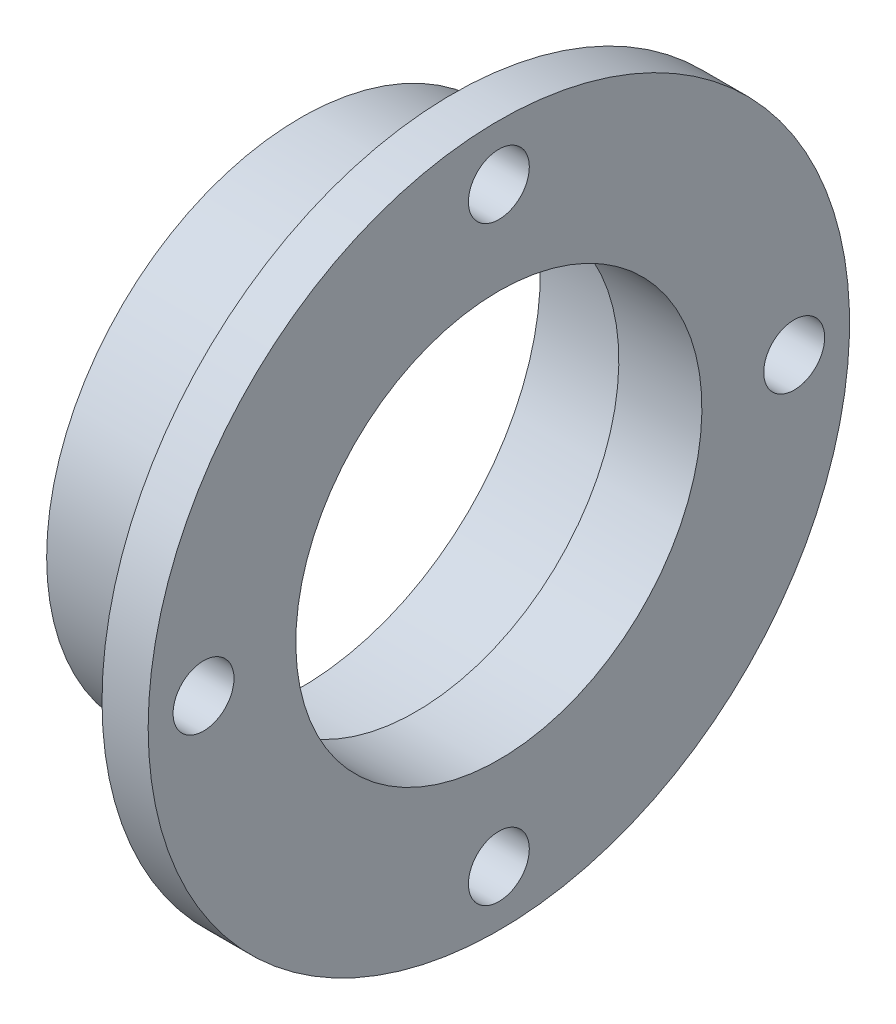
from build123d import *

# Parameters (mm, degrees)
D_GAGEMENT_M61_D             = 6.6
R_P_TITION_CIRCULAIRE1_COUNT = 4


with BuildPart() as part:
    # Esquisse1 → R_volution1 (revolve)
    with BuildSketch(Plane.XY, mode=Mode.PRIVATE) as r_volution1_sk:
        Polygon((0, 0), (0, 38), (-5, 38), (-5, 27.5), (-21.5, 27.5), (-21.5, 0), align=None)
    revolve(r_volution1_sk.sketch.rotate(Axis((0, 0, 0), (1, 0, 0)), 90), axis=Axis((0, 0, 0), (1, 0, 0)))

    # Esquisse2 → Enl_vement de mati_re-R_volution1 (revolve, cut)
    with BuildSketch(Plane.XY):
        Polygon((0, 0), (0, 22), (-9, 22), (-9, 26), (-21.5, 26), (-21.5, 0), align=None)
    revolve(axis=Axis((0, 0, 0), (-1, 0, 0)), mode=Mode.SUBTRACT)

    # D_gagement M61 (through all)
    with Locations(Plane(origin=(0, 0, 0), x_dir=(0, 0, -1), z_dir=(1, 0, 0))):
        with Locations((0, 32)):
            d_gagement_m61 = Hole(D_GAGEMENT_M61_D / 2)

    # R_p_tition circulaire1: D_gagement M61 ×4 about axis
    r_p_tition_circulaire1_axis = Axis((0, 0, 0), (1, 0, 0))
    for i in range(1, R_P_TITION_CIRCULAIRE1_COUNT):
        add(d_gagement_m61.rotate(r_p_tition_circulaire1_axis, i * 360 / R_P_TITION_CIRCULAIRE1_COUNT), mode=Mode.SUBTRACT)


solid = part.part
